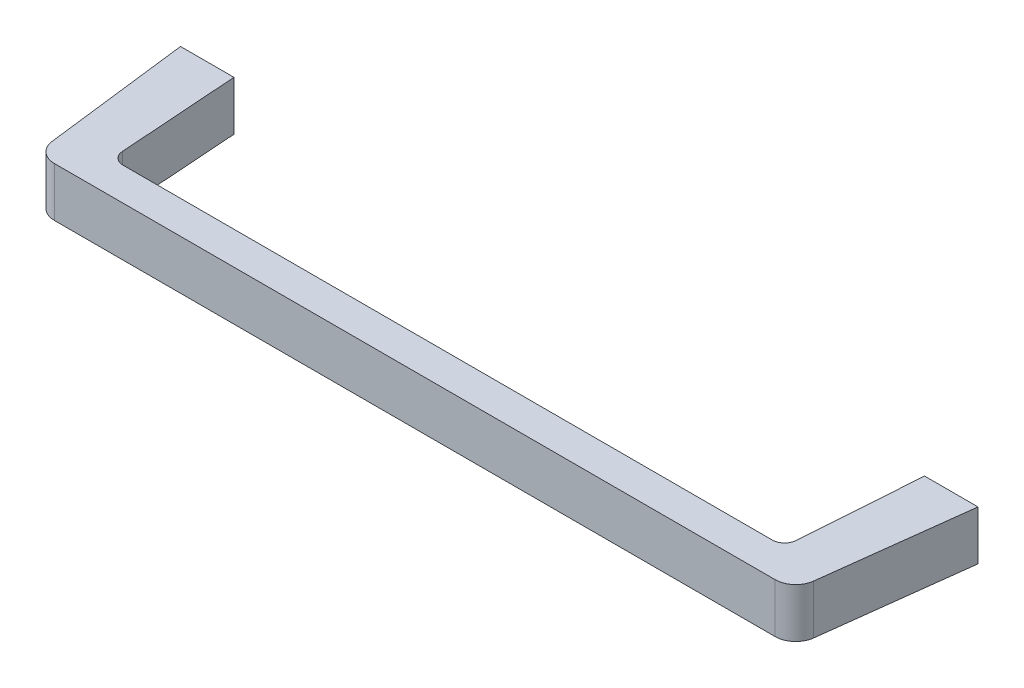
ISO-10303-21;
HEADER;
FILE_DESCRIPTION(('STEP AP214'),'2;1');
FILE_NAME('part.step','',(''),(''),'','','');
FILE_SCHEMA(('AUTOMOTIVE_DESIGN { 1 0 10303 214 1 1 1 1 }'));
ENDSEC;
DATA;
#1=APPLICATION_CONTEXT('core data for automotive mechanical design processes');
#2=APPLICATION_PROTOCOL_DEFINITION('international standard','automotive_design',2000,#1);
#3=PRODUCT_CONTEXT('',#1,'mechanical');
#4=PRODUCT('Part','Part','',(#3));
#5=PRODUCT_RELATED_PRODUCT_CATEGORY('part','',(#4));
#6=PRODUCT_DEFINITION_FORMATION('','',#4);
#7=PRODUCT_DEFINITION_CONTEXT('part definition',#1,'design');
#8=PRODUCT_DEFINITION('design','',#6,#7);
#9=PRODUCT_DEFINITION_SHAPE('','',#8);
#10=(LENGTH_UNIT() NAMED_UNIT(*) SI_UNIT(.MILLI.,.METRE.));
#11=(NAMED_UNIT(*) PLANE_ANGLE_UNIT() SI_UNIT($,.RADIAN.));
#12=(NAMED_UNIT(*) SI_UNIT($,.STERADIAN.) SOLID_ANGLE_UNIT());
#13=UNCERTAINTY_MEASURE_WITH_UNIT(LENGTH_MEASURE(1.E-05),#10,'distance_accuracy_value','');
#14=(GEOMETRIC_REPRESENTATION_CONTEXT(3) GLOBAL_UNCERTAINTY_ASSIGNED_CONTEXT((#13)) GLOBAL_UNIT_ASSIGNED_CONTEXT((#10,
#11,#12)) REPRESENTATION_CONTEXT('',''));
#15=CARTESIAN_POINT('',(0.,0.,0.));
#16=DIRECTION('',(0.,0.,1.));
#17=DIRECTION('',(1.,0.,0.));
#18=AXIS2_PLACEMENT_3D('',#15,#16,#17);
#19=CARTESIAN_POINT('',(-7.,-6.,0.));
#20=DIRECTION('',(0.,0.,1.));
#21=DIRECTION('',(0.,-1.,0.));
#22=AXIS2_PLACEMENT_3D('',#19,#20,#21);
#23=PLANE('',#22);
#24=DIRECTION('',(0.,1.,0.));
#25=VECTOR('',#24,1.);
#26=CARTESIAN_POINT('',(6.,-6.,0.));
#27=LINE('',#26,#25);
#28=CARTESIAN_POINT('',(6.,-6.,0.));
#29=VERTEX_POINT('',#28);
#30=CARTESIAN_POINT('',(6.,6.,0.));
#31=VERTEX_POINT('',#30);
#32=EDGE_CURVE('E196',#29,#31,#27,.T.);
#33=ORIENTED_EDGE('',*,*,#32,.F.);
#34=DIRECTION('',(1.,0.,0.));
#35=VECTOR('',#34,1.);
#36=CARTESIAN_POINT('',(-7.,-6.,0.));
#37=LINE('',#36,#35);
#38=CARTESIAN_POINT('',(-7.,-6.,0.));
#39=VERTEX_POINT('',#38);
#40=EDGE_CURVE('E162',#39,#29,#37,.T.);
#41=ORIENTED_EDGE('',*,*,#40,.F.);
#42=DIRECTION('',(0.,1.,0.));
#43=VECTOR('',#42,1.);
#44=CARTESIAN_POINT('',(-7.,-6.,0.));
#45=LINE('',#44,#43);
#46=CARTESIAN_POINT('',(-7.,6.,0.));
#47=VERTEX_POINT('',#46);
#48=EDGE_CURVE('E198',#39,#47,#45,.T.);
#49=ORIENTED_EDGE('',*,*,#48,.T.);
#50=DIRECTION('',(1.,0.,0.));
#51=VECTOR('',#50,1.);
#52=CARTESIAN_POINT('',(-7.,6.,0.));
#53=LINE('',#52,#51);
#54=EDGE_CURVE('E130',#47,#31,#53,.T.);
#55=ORIENTED_EDGE('',*,*,#54,.T.);
#56=EDGE_LOOP('',(#33,#41,#49,#55));
#57=FACE_BOUND('',#56,.T.);
#58=CARTESIAN_POINT('',(0.,0.,0.));
#59=DIRECTION('',(0.,0.,1.));
#60=DIRECTION('',(0.,-1.,0.));
#61=AXIS2_PLACEMENT_3D('',#58,#59,#60);
#62=CIRCLE('',#61,2.5);
#63=CARTESIAN_POINT('',(0.,-2.5,0.));
#64=VERTEX_POINT('',#63);
#65=EDGE_CURVE('E292',#64,#64,#62,.T.);
#66=ORIENTED_EDGE('',*,*,#65,.T.);
#67=EDGE_LOOP('',(#66));
#68=FACE_BOUND('',#67,.T.);
#69=ADVANCED_FACE('F14',(#57,#68),#23,.F.);
#70=CARTESIAN_POINT('',(177.664991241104,-6.,35.));
#71=DIRECTION('',(0.,1.,0.));
#72=DIRECTION('',(-1.,0.,0.));
#73=AXIS2_PLACEMENT_3D('',#70,#71,#72);
#74=CYLINDRICAL_SURFACE('',#73,5.);
#75=DIRECTION('',(0.,1.,0.));
#76=VECTOR('',#75,1.);
#77=CARTESIAN_POINT('',(177.664991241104,-6.,40.));
#78=LINE('',#77,#76);
#79=CARTESIAN_POINT('',(177.664991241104,-6.,40.));
#80=VERTEX_POINT('',#79);
#81=CARTESIAN_POINT('',(177.664991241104,6.,40.));
#82=VERTEX_POINT('',#81);
#83=EDGE_CURVE('E9',#80,#82,#78,.T.);
#84=ORIENTED_EDGE('',*,*,#83,.F.);
#85=CARTESIAN_POINT('',(177.664991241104,-6.,35.));
#86=DIRECTION('',(0.,-1.,0.));
#87=DIRECTION('',(1.,0.,0.));
#88=AXIS2_PLACEMENT_3D('',#85,#86,#87);
#89=CIRCLE('',#88,5.);
#90=CARTESIAN_POINT('',(182.627721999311,-6.,35.6093467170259));
#91=VERTEX_POINT('',#90);
#92=EDGE_CURVE('E153',#91,#80,#89,.T.);
#93=ORIENTED_EDGE('',*,*,#92,.F.);
#94=DIRECTION('',(0.,1.,0.));
#95=VECTOR('',#94,1.);
#96=CARTESIAN_POINT('',(182.627721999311,-6.,35.6093467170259));
#97=LINE('',#96,#95);
#98=CARTESIAN_POINT('',(182.627721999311,6.,35.6093467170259));
#99=VERTEX_POINT('',#98);
#100=EDGE_CURVE('E29',#91,#99,#97,.T.);
#101=ORIENTED_EDGE('',*,*,#100,.T.);
#102=CARTESIAN_POINT('',(177.664991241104,6.,35.));
#103=DIRECTION('',(0.,-1.,0.));
#104=DIRECTION('',(1.,0.,0.));
#105=AXIS2_PLACEMENT_3D('',#102,#103,#104);
#106=CIRCLE('',#105,5.);
#107=EDGE_CURVE('E113',#99,#82,#106,.T.);
#108=ORIENTED_EDGE('',*,*,#107,.T.);
#109=EDGE_LOOP('',(#84,#93,#101,#108));
#110=FACE_BOUND('',#109,.T.);
#111=ADVANCED_FACE('F114',(#110),#74,.T.);
#112=CARTESIAN_POINT('',(177.664991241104,-6.,40.));
#113=DIRECTION('',(0.,0.,-1.));
#114=DIRECTION('',(1.,0.,0.));
#115=AXIS2_PLACEMENT_3D('',#112,#113,#114);
#116=PLANE('',#115);
#117=DIRECTION('',(0.,1.,0.));
#118=VECTOR('',#117,1.);
#119=CARTESIAN_POINT('',(2.33500875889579,-6.,40.));
#120=LINE('',#119,#118);
#121=CARTESIAN_POINT('',(2.33500875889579,-6.,40.));
#122=VERTEX_POINT('',#121);
#123=CARTESIAN_POINT('',(2.33500875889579,6.,40.));
#124=VERTEX_POINT('',#123);
#125=EDGE_CURVE('E22',#122,#124,#120,.T.);
#126=ORIENTED_EDGE('',*,*,#125,.F.);
#127=DIRECTION('',(-1.,0.,0.));
#128=VECTOR('',#127,1.);
#129=CARTESIAN_POINT('',(177.664991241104,-6.,40.));
#130=LINE('',#129,#128);
#131=EDGE_CURVE('E109',#80,#122,#130,.T.);
#132=ORIENTED_EDGE('',*,*,#131,.F.);
#133=ORIENTED_EDGE('',*,*,#83,.T.);
#134=DIRECTION('',(-1.,0.,0.));
#135=VECTOR('',#134,1.);
#136=CARTESIAN_POINT('',(177.664991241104,6.,40.));
#137=LINE('',#136,#135);
#138=EDGE_CURVE('E106',#82,#124,#137,.T.);
#139=ORIENTED_EDGE('',*,*,#138,.T.);
#140=EDGE_LOOP('',(#126,#132,#133,#139));
#141=FACE_BOUND('',#140,.T.);
#142=ADVANCED_FACE('F16',(#141),#116,.F.);
#143=CARTESIAN_POINT('',(2.33500875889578,-6.,35.));
#144=DIRECTION('',(0.,1.,0.));
#145=DIRECTION('',(-1.,0.,0.));
#146=AXIS2_PLACEMENT_3D('',#143,#144,#145);
#147=CYLINDRICAL_SURFACE('',#146,5.);
#148=DIRECTION('',(0.,1.,0.));
#149=VECTOR('',#148,1.);
#150=CARTESIAN_POINT('',(-2.6277219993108,-6.,35.6093467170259));
#151=LINE('',#150,#149);
#152=CARTESIAN_POINT('',(-2.6277219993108,-6.,35.6093467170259));
#153=VERTEX_POINT('',#152);
#154=CARTESIAN_POINT('',(-2.6277219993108,6.,35.6093467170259));
#155=VERTEX_POINT('',#154);
#156=EDGE_CURVE('E200',#153,#155,#151,.T.);
#157=ORIENTED_EDGE('',*,*,#156,.F.);
#158=CARTESIAN_POINT('',(2.33500875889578,-6.,35.));
#159=DIRECTION('',(0.,-1.,0.));
#160=DIRECTION('',(1.,0.,0.));
#161=AXIS2_PLACEMENT_3D('',#158,#159,#160);
#162=CIRCLE('',#161,5.);
#163=EDGE_CURVE('E156',#122,#153,#162,.T.);
#164=ORIENTED_EDGE('',*,*,#163,.F.);
#165=ORIENTED_EDGE('',*,*,#125,.T.);
#166=CARTESIAN_POINT('',(2.33500875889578,6.,35.));
#167=DIRECTION('',(0.,-1.,0.));
#168=DIRECTION('',(1.,0.,0.));
#169=AXIS2_PLACEMENT_3D('',#166,#167,#168);
#170=CIRCLE('',#169,5.);
#171=EDGE_CURVE('E122',#124,#155,#170,.T.);
#172=ORIENTED_EDGE('',*,*,#171,.T.);
#173=EDGE_LOOP('',(#157,#164,#165,#172));
#174=FACE_BOUND('',#173,.T.);
#175=ADVANCED_FACE('F203',(#174),#147,.T.);
#176=CARTESIAN_POINT('',(-2.6277219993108,-6.,35.6093467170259));
#177=DIRECTION('',(0.992546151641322,0.,-0.121869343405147));
#178=DIRECTION('',(0.121869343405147,0.,0.992546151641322));
#179=AXIS2_PLACEMENT_3D('',#176,#177,#178);
#180=PLANE('',#179);
#181=ORIENTED_EDGE('',*,*,#48,.F.);
#182=DIRECTION('',(-0.121869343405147,0.,-0.992546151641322));
#183=VECTOR('',#182,1.);
#184=CARTESIAN_POINT('',(-2.6277219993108,-6.,35.6093467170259));
#185=LINE('',#184,#183);
#186=EDGE_CURVE('E159',#153,#39,#185,.T.);
#187=ORIENTED_EDGE('',*,*,#186,.F.);
#188=ORIENTED_EDGE('',*,*,#156,.T.);
#189=DIRECTION('',(-0.121869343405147,0.,-0.992546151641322));
#190=VECTOR('',#189,1.);
#191=CARTESIAN_POINT('',(-2.6277219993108,6.,35.6093467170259));
#192=LINE('',#191,#190);
#193=EDGE_CURVE('E124',#155,#47,#192,.T.);
#194=ORIENTED_EDGE('',*,*,#193,.T.);
#195=EDGE_LOOP('',(#181,#187,#188,#194));
#196=FACE_BOUND('',#195,.T.);
#197=ADVANCED_FACE('F235',(#196),#180,.F.);
#198=CARTESIAN_POINT('',(6.,-6.,0.));
#199=DIRECTION('',(-0.997564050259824,0.,0.0697564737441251));
#200=DIRECTION('',(-0.0697564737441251,0.,-0.997564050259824));
#201=AXIS2_PLACEMENT_3D('',#198,#199,#200);
#202=PLANE('',#201);
#203=DIRECTION('',(0.,1.,0.));
#204=VECTOR('',#203,1.);
#205=CARTESIAN_POINT('',(8.0425110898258,-6.,29.2092694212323));
#206=LINE('',#205,#204);
#207=CARTESIAN_POINT('',(8.0425110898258,-6.,29.2092694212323));
#208=VERTEX_POINT('',#207);
#209=CARTESIAN_POINT('',(8.0425110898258,6.,29.2092694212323));
#210=VERTEX_POINT('',#209);
#211=EDGE_CURVE('E194',#208,#210,#206,.T.);
#212=ORIENTED_EDGE('',*,*,#211,.F.);
#213=DIRECTION('',(0.0697564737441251,0.,0.997564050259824));
#214=VECTOR('',#213,1.);
#215=CARTESIAN_POINT('',(6.,-6.,0.));
#216=LINE('',#215,#214);
#217=EDGE_CURVE('E165',#29,#208,#216,.T.);
#218=ORIENTED_EDGE('',*,*,#217,.F.);
#219=ORIENTED_EDGE('',*,*,#32,.T.);
#220=DIRECTION('',(0.0697564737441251,0.,0.997564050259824));
#221=VECTOR('',#220,1.);
#222=CARTESIAN_POINT('',(6.,6.,0.));
#223=LINE('',#222,#221);
#224=EDGE_CURVE('E133',#31,#210,#223,.T.);
#225=ORIENTED_EDGE('',*,*,#224,.T.);
#226=EDGE_LOOP('',(#212,#218,#219,#225));
#227=FACE_BOUND('',#226,.T.);
#228=ADVANCED_FACE('F230',(#227),#202,.F.);
#229=CARTESIAN_POINT('',(11.0352032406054,-6.,29.));
#230=DIRECTION('',(0.,1.,0.));
#231=DIRECTION('',(-1.,0.,0.));
#232=AXIS2_PLACEMENT_3D('',#229,#230,#231);
#233=CYLINDRICAL_SURFACE('',#232,3.);
#234=DIRECTION('',(0.,1.,0.));
#235=VECTOR('',#234,1.);
#236=CARTESIAN_POINT('',(11.0352032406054,-6.,32.));
#237=LINE('',#236,#235);
#238=CARTESIAN_POINT('',(11.0352032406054,-6.,32.));
#239=VERTEX_POINT('',#238);
#240=CARTESIAN_POINT('',(11.0352032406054,6.,32.));
#241=VERTEX_POINT('',#240);
#242=EDGE_CURVE('E192',#239,#241,#237,.T.);
#243=ORIENTED_EDGE('',*,*,#242,.F.);
#244=CARTESIAN_POINT('',(11.0352032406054,-6.,29.));
#245=DIRECTION('',(0.,-1.,0.));
#246=DIRECTION('',(1.,0.,0.));
#247=AXIS2_PLACEMENT_3D('',#244,#245,#246);
#248=CIRCLE('',#247,3.);
#249=EDGE_CURVE('E168',#239,#208,#248,.T.);
#250=ORIENTED_EDGE('',*,*,#249,.T.);
#251=ORIENTED_EDGE('',*,*,#211,.T.);
#252=CARTESIAN_POINT('',(11.0352032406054,6.,29.));
#253=DIRECTION('',(0.,-1.,0.));
#254=DIRECTION('',(1.,0.,0.));
#255=AXIS2_PLACEMENT_3D('',#252,#253,#254);
#256=CIRCLE('',#255,3.);
#257=EDGE_CURVE('E136',#241,#210,#256,.T.);
#258=ORIENTED_EDGE('',*,*,#257,.F.);
#259=EDGE_LOOP('',(#243,#250,#251,#258));
#260=FACE_BOUND('',#259,.T.);
#261=ADVANCED_FACE('F226',(#260),#233,.F.);
#262=CARTESIAN_POINT('',(11.0352032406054,-6.,32.));
#263=DIRECTION('',(0.,0.,1.));
#264=DIRECTION('',(0.,-1.,0.));
#265=AXIS2_PLACEMENT_3D('',#262,#263,#264);
#266=PLANE('',#265);
#267=DIRECTION('',(0.,1.,0.));
#268=VECTOR('',#267,1.);
#269=CARTESIAN_POINT('',(168.964796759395,-6.,32.));
#270=LINE('',#269,#268);
#271=CARTESIAN_POINT('',(168.964796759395,-6.,32.));
#272=VERTEX_POINT('',#271);
#273=CARTESIAN_POINT('',(168.964796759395,6.,32.));
#274=VERTEX_POINT('',#273);
#275=EDGE_CURVE('E190',#272,#274,#270,.T.);
#276=ORIENTED_EDGE('',*,*,#275,.F.);
#277=DIRECTION('',(1.,0.,0.));
#278=VECTOR('',#277,1.);
#279=CARTESIAN_POINT('',(11.0352032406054,-6.,32.));
#280=LINE('',#279,#278);
#281=EDGE_CURVE('E171',#239,#272,#280,.T.);
#282=ORIENTED_EDGE('',*,*,#281,.F.);
#283=ORIENTED_EDGE('',*,*,#242,.T.);
#284=DIRECTION('',(1.,0.,0.));
#285=VECTOR('',#284,1.);
#286=CARTESIAN_POINT('',(11.0352032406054,6.,32.));
#287=LINE('',#286,#285);
#288=EDGE_CURVE('E139',#241,#274,#287,.T.);
#289=ORIENTED_EDGE('',*,*,#288,.T.);
#290=EDGE_LOOP('',(#276,#282,#283,#289));
#291=FACE_BOUND('',#290,.T.);
#292=ADVANCED_FACE('F221',(#291),#266,.F.);
#293=CARTESIAN_POINT('',(168.964796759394,-6.,29.));
#294=DIRECTION('',(0.,1.,0.));
#295=DIRECTION('',(-1.,0.,0.));
#296=AXIS2_PLACEMENT_3D('',#293,#294,#295);
#297=CYLINDRICAL_SURFACE('',#296,3.);
#298=DIRECTION('',(0.,1.,0.));
#299=VECTOR('',#298,1.);
#300=CARTESIAN_POINT('',(171.957488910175,-6.,29.2092694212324));
#301=LINE('',#300,#299);
#302=CARTESIAN_POINT('',(171.957488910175,-6.,29.2092694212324));
#303=VERTEX_POINT('',#302);
#304=CARTESIAN_POINT('',(171.957488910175,6.,29.2092694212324));
#305=VERTEX_POINT('',#304);
#306=EDGE_CURVE('E188',#303,#305,#301,.T.);
#307=ORIENTED_EDGE('',*,*,#306,.F.);
#308=CARTESIAN_POINT('',(168.964796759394,-6.,29.));
#309=DIRECTION('',(0.,-1.,0.));
#310=DIRECTION('',(1.,0.,0.));
#311=AXIS2_PLACEMENT_3D('',#308,#309,#310);
#312=CIRCLE('',#311,3.);
#313=EDGE_CURVE('E174',#303,#272,#312,.T.);
#314=ORIENTED_EDGE('',*,*,#313,.T.);
#315=ORIENTED_EDGE('',*,*,#275,.T.);
#316=CARTESIAN_POINT('',(168.964796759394,6.,29.));
#317=DIRECTION('',(0.,-1.,0.));
#318=DIRECTION('',(1.,0.,0.));
#319=AXIS2_PLACEMENT_3D('',#316,#317,#318);
#320=CIRCLE('',#319,3.);
#321=EDGE_CURVE('E142',#305,#274,#320,.T.);
#322=ORIENTED_EDGE('',*,*,#321,.F.);
#323=EDGE_LOOP('',(#307,#314,#315,#322));
#324=FACE_BOUND('',#323,.T.);
#325=ADVANCED_FACE('F218',(#324),#297,.F.);
#326=CARTESIAN_POINT('',(174.,-6.,0.));
#327=DIRECTION('',(-0.997564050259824,0.,-0.0697564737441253));
#328=DIRECTION('',(0.0697564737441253,0.,-0.997564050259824));
#329=AXIS2_PLACEMENT_3D('',#326,#327,#328);
#330=PLANE('',#329);
#331=DIRECTION('',(0.,1.,0.));
#332=VECTOR('',#331,1.);
#333=CARTESIAN_POINT('',(174.,-6.,0.));
#334=LINE('',#333,#332);
#335=CARTESIAN_POINT('',(174.,-6.,0.));
#336=VERTEX_POINT('',#335);
#337=CARTESIAN_POINT('',(174.,6.,0.));
#338=VERTEX_POINT('',#337);
#339=EDGE_CURVE('E186',#336,#338,#334,.T.);
#340=ORIENTED_EDGE('',*,*,#339,.F.);
#341=DIRECTION('',(-0.0697564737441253,0.,0.997564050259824));
#342=VECTOR('',#341,1.);
#343=CARTESIAN_POINT('',(174.,-6.,0.));
#344=LINE('',#343,#342);
#345=EDGE_CURVE('E177',#336,#303,#344,.T.);
#346=ORIENTED_EDGE('',*,*,#345,.T.);
#347=ORIENTED_EDGE('',*,*,#306,.T.);
#348=DIRECTION('',(-0.0697564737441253,0.,0.997564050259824));
#349=VECTOR('',#348,1.);
#350=CARTESIAN_POINT('',(174.,6.,0.));
#351=LINE('',#350,#349);
#352=EDGE_CURVE('E145',#338,#305,#351,.T.);
#353=ORIENTED_EDGE('',*,*,#352,.F.);
#354=EDGE_LOOP('',(#340,#346,#347,#353));
#355=FACE_BOUND('',#354,.T.);
#356=ADVANCED_FACE('F215',(#355),#330,.T.);
#357=CARTESIAN_POINT('',(187.,-6.,0.));
#358=DIRECTION('',(0.,0.,-1.));
#359=DIRECTION('',(0.,1.,0.));
#360=AXIS2_PLACEMENT_3D('',#357,#358,#359);
#361=PLANE('',#360);
#362=CARTESIAN_POINT('',(180.,0.,0.));
#363=DIRECTION('',(0.,0.,-1.));
#364=DIRECTION('',(0.,1.,0.));
#365=AXIS2_PLACEMENT_3D('',#362,#363,#364);
#366=CIRCLE('',#365,2.5);
#367=CARTESIAN_POINT('',(180.,2.5,0.));
#368=VERTEX_POINT('',#367);
#369=EDGE_CURVE('E291',#368,#368,#366,.T.);
#370=ORIENTED_EDGE('',*,*,#369,.F.);
#371=EDGE_LOOP('',(#370));
#372=FACE_BOUND('',#371,.T.);
#373=DIRECTION('',(0.,1.,0.));
#374=VECTOR('',#373,1.);
#375=CARTESIAN_POINT('',(187.,-6.,0.));
#376=LINE('',#375,#374);
#377=CARTESIAN_POINT('',(187.,-6.,0.));
#378=VERTEX_POINT('',#377);
#379=CARTESIAN_POINT('',(187.,6.,0.));
#380=VERTEX_POINT('',#379);
#381=EDGE_CURVE('E37',#378,#380,#376,.T.);
#382=ORIENTED_EDGE('',*,*,#381,.F.);
#383=DIRECTION('',(-1.,0.,0.));
#384=VECTOR('',#383,1.);
#385=CARTESIAN_POINT('',(187.,-6.,0.));
#386=LINE('',#385,#384);
#387=EDGE_CURVE('E180',#378,#336,#386,.T.);
#388=ORIENTED_EDGE('',*,*,#387,.T.);
#389=ORIENTED_EDGE('',*,*,#339,.T.);
#390=DIRECTION('',(-1.,0.,0.));
#391=VECTOR('',#390,1.);
#392=CARTESIAN_POINT('',(187.,6.,0.));
#393=LINE('',#392,#391);
#394=EDGE_CURVE('E148',#380,#338,#393,.T.);
#395=ORIENTED_EDGE('',*,*,#394,.F.);
#396=EDGE_LOOP('',(#382,#388,#389,#395));
#397=FACE_BOUND('',#396,.T.);
#398=ADVANCED_FACE('F210',(#372,#397),#361,.T.);
#399=CARTESIAN_POINT('',(182.627721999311,-6.,35.6093467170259));
#400=DIRECTION('',(0.992546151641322,0.,0.121869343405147));
#401=DIRECTION('',(-0.121869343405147,0.,0.992546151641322));
#402=AXIS2_PLACEMENT_3D('',#399,#400,#401);
#403=PLANE('',#402);
#404=DIRECTION('',(0.121869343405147,0.,-0.992546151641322));
#405=VECTOR('',#404,1.);
#406=CARTESIAN_POINT('',(182.627721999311,-6.,35.6093467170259));
#407=LINE('',#406,#405);
#408=EDGE_CURVE('E182',#91,#378,#407,.T.);
#409=ORIENTED_EDGE('',*,*,#408,.T.);
#410=ORIENTED_EDGE('',*,*,#381,.T.);
#411=DIRECTION('',(0.121869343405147,0.,-0.992546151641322));
#412=VECTOR('',#411,1.);
#413=CARTESIAN_POINT('',(182.627721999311,6.,35.6093467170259));
#414=LINE('',#413,#412);
#415=EDGE_CURVE('E151',#99,#380,#414,.T.);
#416=ORIENTED_EDGE('',*,*,#415,.F.);
#417=ORIENTED_EDGE('',*,*,#100,.F.);
#418=EDGE_LOOP('',(#409,#410,#416,#417));
#419=FACE_BOUND('',#418,.T.);
#420=ADVANCED_FACE('F209',(#419),#403,.T.);
#421=CARTESIAN_POINT('',(177.664991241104,-6.,35.));
#422=DIRECTION('',(0.,-1.,0.));
#423=DIRECTION('',(1.,0.,0.));
#424=AXIS2_PLACEMENT_3D('',#421,#422,#423);
#425=PLANE('',#424);
#426=ORIENTED_EDGE('',*,*,#92,.T.);
#427=ORIENTED_EDGE('',*,*,#131,.T.);
#428=ORIENTED_EDGE('',*,*,#163,.T.);
#429=ORIENTED_EDGE('',*,*,#186,.T.);
#430=ORIENTED_EDGE('',*,*,#40,.T.);
#431=ORIENTED_EDGE('',*,*,#217,.T.);
#432=ORIENTED_EDGE('',*,*,#249,.F.);
#433=ORIENTED_EDGE('',*,*,#281,.T.);
#434=ORIENTED_EDGE('',*,*,#313,.F.);
#435=ORIENTED_EDGE('',*,*,#345,.F.);
#436=ORIENTED_EDGE('',*,*,#387,.F.);
#437=ORIENTED_EDGE('',*,*,#408,.F.);
#438=EDGE_LOOP('',(#426,#427,#428,#429,#430,#431,#432,#433,#434,#435,#436,#437));
#439=FACE_BOUND('',#438,.T.);
#440=ADVANCED_FACE('F205',(#439),#425,.T.);
#441=CARTESIAN_POINT('',(177.664991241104,6.,35.));
#442=DIRECTION('',(0.,-1.,0.));
#443=DIRECTION('',(1.,0.,0.));
#444=AXIS2_PLACEMENT_3D('',#441,#442,#443);
#445=PLANE('',#444);
#446=ORIENTED_EDGE('',*,*,#107,.F.);
#447=ORIENTED_EDGE('',*,*,#415,.T.);
#448=ORIENTED_EDGE('',*,*,#394,.T.);
#449=ORIENTED_EDGE('',*,*,#352,.T.);
#450=ORIENTED_EDGE('',*,*,#321,.T.);
#451=ORIENTED_EDGE('',*,*,#288,.F.);
#452=ORIENTED_EDGE('',*,*,#257,.T.);
#453=ORIENTED_EDGE('',*,*,#224,.F.);
#454=ORIENTED_EDGE('',*,*,#54,.F.);
#455=ORIENTED_EDGE('',*,*,#193,.F.);
#456=ORIENTED_EDGE('',*,*,#171,.F.);
#457=ORIENTED_EDGE('',*,*,#138,.F.);
#458=EDGE_LOOP('',(#446,#447,#448,#449,#450,#451,#452,#453,#454,#455,#456,#457));
#459=FACE_BOUND('',#458,.T.);
#460=ADVANCED_FACE('F119',(#459),#445,.F.);
#461=CARTESIAN_POINT('',(180.,0.,10.));
#462=DIRECTION('',(0.,0.,-1.));
#463=DIRECTION('',(0.,1.,0.));
#464=AXIS2_PLACEMENT_3D('',#461,#462,#463);
#465=CYLINDRICAL_SURFACE('',#464,2.5);
#466=CARTESIAN_POINT('',(180.,0.,10.));
#467=DIRECTION('',(0.,0.,-1.));
#468=DIRECTION('',(0.,1.,0.));
#469=AXIS2_PLACEMENT_3D('',#466,#467,#468);
#470=CIRCLE('',#469,2.5);
#471=CARTESIAN_POINT('',(180.,2.5,10.));
#472=VERTEX_POINT('',#471);
#473=EDGE_CURVE('E117',#472,#472,#470,.T.);
#474=ORIENTED_EDGE('',*,*,#473,.F.);
#475=EDGE_LOOP('',(#474));
#476=FACE_BOUND('',#475,.T.);
#477=ORIENTED_EDGE('',*,*,#369,.T.);
#478=EDGE_LOOP('',(#477));
#479=FACE_BOUND('',#478,.T.);
#480=ADVANCED_FACE('F270',(#476,#479),#465,.F.);
#481=CARTESIAN_POINT('',(180.,0.,10.));
#482=DIRECTION('',(0.,0.,-1.));
#483=DIRECTION('',(0.,1.,0.));
#484=AXIS2_PLACEMENT_3D('',#481,#482,#483);
#485=PLANE('',#484);
#486=ORIENTED_EDGE('',*,*,#473,.T.);
#487=EDGE_LOOP('',(#486));
#488=FACE_BOUND('',#487,.T.);
#489=ADVANCED_FACE('F271',(#488),#485,.T.);
#490=CARTESIAN_POINT('',(0.,0.,10.));
#491=DIRECTION('',(0.,0.,-1.));
#492=DIRECTION('',(0.,1.,0.));
#493=AXIS2_PLACEMENT_3D('',#490,#491,#492);
#494=CYLINDRICAL_SURFACE('',#493,2.5);
#495=CARTESIAN_POINT('',(0.,0.,10.));
#496=DIRECTION('',(0.,0.,1.));
#497=DIRECTION('',(0.,-1.,0.));
#498=AXIS2_PLACEMENT_3D('',#495,#496,#497);
#499=CIRCLE('',#498,2.5);
#500=CARTESIAN_POINT('',(0.,-2.5,10.));
#501=VERTEX_POINT('',#500);
#502=EDGE_CURVE('E290',#501,#501,#499,.T.);
#503=ORIENTED_EDGE('',*,*,#502,.T.);
#504=EDGE_LOOP('',(#503));
#505=FACE_BOUND('',#504,.T.);
#506=ORIENTED_EDGE('',*,*,#65,.F.);
#507=EDGE_LOOP('',(#506));
#508=FACE_BOUND('',#507,.T.);
#509=ADVANCED_FACE('F278',(#505,#508),#494,.F.);
#510=CARTESIAN_POINT('',(0.,0.,10.));
#511=DIRECTION('',(0.,0.,1.));
#512=DIRECTION('',(0.,-1.,0.));
#513=AXIS2_PLACEMENT_3D('',#510,#511,#512);
#514=PLANE('',#513);
#515=ORIENTED_EDGE('',*,*,#502,.F.);
#516=EDGE_LOOP('',(#515));
#517=FACE_BOUND('',#516,.T.);
#518=ADVANCED_FACE('F275',(#517),#514,.F.);
#519=CLOSED_SHELL('',(#69,#111,#142,#175,#197,#228,#261,#292,#325,#356,#398,#420,#440,#460,#480,
#489,#509,#518));
#520=MANIFOLD_SOLID_BREP('B1',#519);
#521=ADVANCED_BREP_SHAPE_REPRESENTATION('',(#18,#520),#14);
#522=SHAPE_DEFINITION_REPRESENTATION(#9,#521);
ENDSEC;
END-ISO-10303-21;
